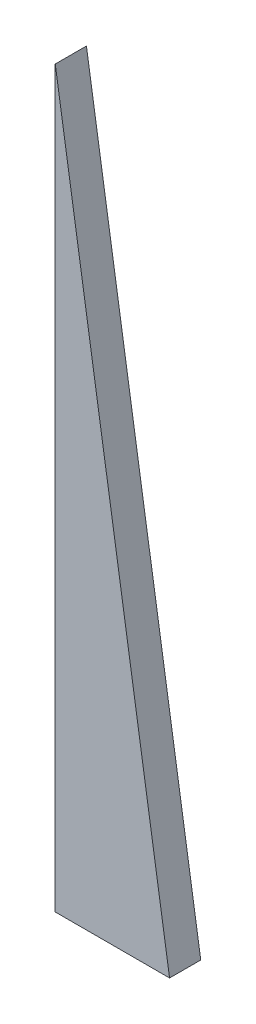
from build123d import *

# Parameters (mm, degrees)
SKETCH1_W           = 139.7
SKETCH1_H           = 38.1
BOSS_EXTRUDE1_DEPTH = 897.382
CUT_EXTRUDE1_DEPTH  = 769.874


with BuildPart() as part:
    # Sketch1 → Boss-Extrude1 (new body)
    with BuildSketch(Plane(origin=(0, 0, 0), x_dir=(1, 0, 0), z_dir=(0, 1, 0))):
        with Locations((-4.933681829, -16.294054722)):
            Rectangle(SKETCH1_W, SKETCH1_H)
    extrude(amount=BOSS_EXTRUDE1_DEPTH)

    # Sketch2 → Cut-Extrude1 (cut)
    with BuildSketch(Plane.XY.offset(35.344054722)):
        Polygon((-74.783681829, 897.382), (64.916318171, 0), (64.916318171, 897.382), align=None)
    extrude(amount=-CUT_EXTRUDE1_DEPTH, mode=Mode.SUBTRACT)


solid = part.part
